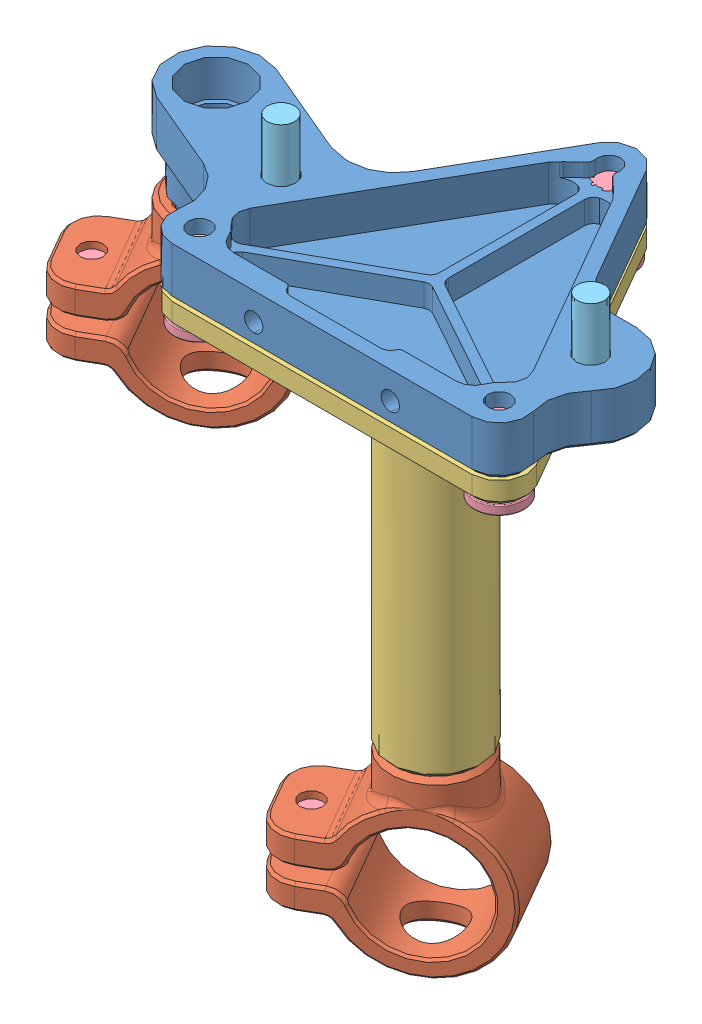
SolidWorks assembly M600 MODULE MOUNT_2-001.sldasm, configuration Default (file format 9000). Lengths in mm.
Overall size (71.88 70.3 50.95).
13 component instances, 5 part files, 0 mates.
Components (placement in the parent):
- M600 MODULE MOUNT_2-01-1: M600 MODULE MOUNT_2-01.sldprt [Default] x (1 0 0) z (0 -1 0) size (56.3 34.5 12.5)
- M600 MODULE MOUNT_2-02-1: M600 MODULE MOUNT_2-02.sldprt [Default] at (0 -52.5 -45) x (0.866025 0 -0.5) z (0.5 0 0.866025) size (21 19 10.17)
- M600 MODULE MOUNT_2-03-1: M600 MODULE MOUNT_2-03.sldprt [Default] at (0 -41.5 -45) x (-0.5 0 0.866025) z (-0.866025 0 -0.5) size (38.91 42 34.5)
- M600 MODULE MOUNT_2-02-2: M600 MODULE MOUNT_2-02.sldprt [Default] at (-29.3 -17.5 -50.1962) x (0.866025 0 -0.5) z (0.5 0 0.866025) size (21 19 10.17)
- D600 BASE_3-12-1: D600 BASE_3-12.sldprt [Default] at (-16.4545 -5 -35.5) x (0.999947 0 0.010342) z (0 1 0) size (5.5 5.5 7.5)
- D600 BASE_3-12-2: D600 BASE_3-12.sldprt [Default] at (16.4545 -5 -35.5) x (0.999947 0 0.010342) z (0 1 0) size (5.5 5.5 7.5)
- D600 BASE_3-12-3: D600 BASE_3-12.sldprt [Default] at (0 -5 -64) x (0.999947 0 0.010342) z (0 1 0) size (5.5 5.5 7.5)
- D600 BASE_3-12-4: D600 BASE_3-12.sldprt [Default] at (-37.9603 -22 -45.1962) x (0.999947 0 0.010342) z (0 1 0) size (5.5 5.5 7.5)
- D600 BASE_3-12-5: D600 BASE_3-12.sldprt [Default] at (-29.3 -11 -50.1962) x (0.999947 0 0.010342) z (0 1 0) size (5.5 5.5 7.5)
- D600 BASE_3-12-6: D600 BASE_3-12.sldprt [Default] at (-8.6603 -57 -40) x (0.999947 0 0.010342) z (0 1 0) size (5.5 5.5 7.5)
- D600 BASE_3-12-7: D600 BASE_3-12.sldprt [Default] at (0 -46 -45) x (0.999947 0 0.010342) z (0 1 0) size (5.5 5.5 7.5)
- D600 BASE_6-08-1: D600 BASE_6-08.sldprt [Default] at (-17 1 -45) x (0.957409 0 0.288735) z (0 1 0) size (5.5 5.5 8.8)
- D600 BASE_6-08-2: D600 BASE_6-08.sldprt [Default] at (17 1 -45) x (0.957409 0 0.288735) z (0 1 0) size (5.5 5.5 8.8)
